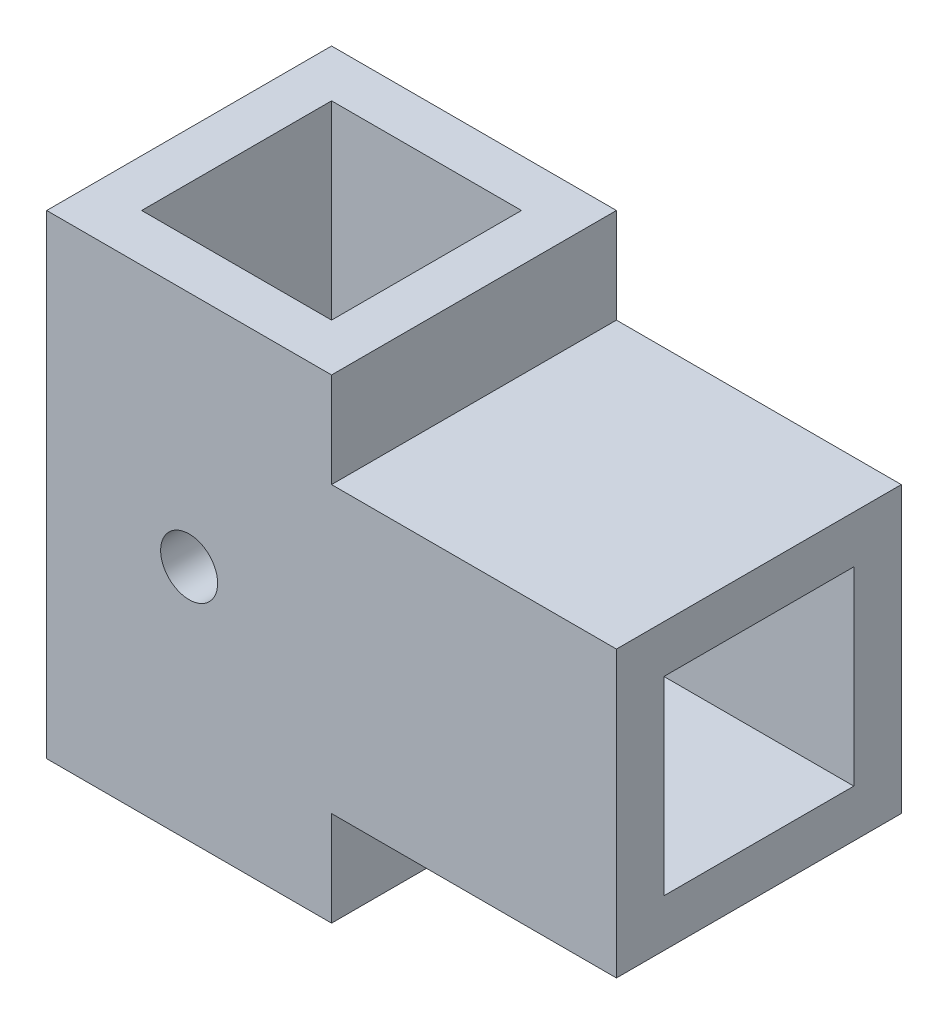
ISO-10303-21;
HEADER;
FILE_DESCRIPTION(('STEP AP214'),'2;1');
FILE_NAME('part.step','',(''),(''),'','','');
FILE_SCHEMA(('AUTOMOTIVE_DESIGN { 1 0 10303 214 1 1 1 1 }'));
ENDSEC;
DATA;
#1=APPLICATION_CONTEXT('core data for automotive mechanical design processes');
#2=APPLICATION_PROTOCOL_DEFINITION('international standard','automotive_design',2000,#1);
#3=PRODUCT_CONTEXT('',#1,'mechanical');
#4=PRODUCT('Part','Part','',(#3));
#5=PRODUCT_RELATED_PRODUCT_CATEGORY('part','',(#4));
#6=PRODUCT_DEFINITION_FORMATION('','',#4);
#7=PRODUCT_DEFINITION_CONTEXT('part definition',#1,'design');
#8=PRODUCT_DEFINITION('design','',#6,#7);
#9=PRODUCT_DEFINITION_SHAPE('','',#8);
#10=(LENGTH_UNIT() NAMED_UNIT(*) SI_UNIT(.MILLI.,.METRE.));
#11=(NAMED_UNIT(*) PLANE_ANGLE_UNIT() SI_UNIT($,.RADIAN.));
#12=(NAMED_UNIT(*) SI_UNIT($,.STERADIAN.) SOLID_ANGLE_UNIT());
#13=UNCERTAINTY_MEASURE_WITH_UNIT(LENGTH_MEASURE(1.E-05),#10,'distance_accuracy_value','');
#14=(GEOMETRIC_REPRESENTATION_CONTEXT(3) GLOBAL_UNCERTAINTY_ASSIGNED_CONTEXT((#13)) GLOBAL_UNIT_ASSIGNED_CONTEXT((#10,
#11,#12)) REPRESENTATION_CONTEXT('',''));
#15=CARTESIAN_POINT('',(0.,0.,0.));
#16=DIRECTION('',(0.,0.,1.));
#17=DIRECTION('',(1.,0.,0.));
#18=AXIS2_PLACEMENT_3D('',#15,#16,#17);
#19=CARTESIAN_POINT('',(0.,0.,15.));
#20=DIRECTION('',(0.,0.,-1.));
#21=DIRECTION('',(-1.,0.,0.));
#22=AXIS2_PLACEMENT_3D('',#19,#20,#21);
#23=CYLINDRICAL_SURFACE('',#22,3.);
#24=CARTESIAN_POINT('',(0.,0.,10.));
#25=DIRECTION('',(0.,0.,1.));
#26=DIRECTION('',(1.,0.,0.));
#27=AXIS2_PLACEMENT_3D('',#24,#25,#26);
#28=CIRCLE('',#27,3.);
#29=CARTESIAN_POINT('',(3.,0.,10.));
#30=VERTEX_POINT('',#29);
#31=EDGE_CURVE('E215',#30,#30,#28,.T.);
#32=ORIENTED_EDGE('',*,*,#31,.F.);
#33=EDGE_LOOP('',(#32));
#34=FACE_BOUND('',#33,.T.);
#35=CARTESIAN_POINT('',(0.,0.,15.));
#36=DIRECTION('',(0.,0.,1.));
#37=DIRECTION('',(1.,0.,0.));
#38=AXIS2_PLACEMENT_3D('',#35,#36,#37);
#39=CIRCLE('',#38,3.);
#40=CARTESIAN_POINT('',(3.,0.,15.));
#41=VERTEX_POINT('',#40);
#42=EDGE_CURVE('E220',#41,#41,#39,.T.);
#43=ORIENTED_EDGE('',*,*,#42,.T.);
#44=EDGE_LOOP('',(#43));
#45=FACE_BOUND('',#44,.T.);
#46=ADVANCED_FACE('F41',(#34,#45),#23,.F.);
#47=CARTESIAN_POINT('',(0.,0.,15.));
#48=DIRECTION('',(0.,0.,1.));
#49=DIRECTION('',(1.,0.,0.));
#50=AXIS2_PLACEMENT_3D('',#47,#48,#49);
#51=PLANE('',#50);
#52=DIRECTION('',(-1.,0.,0.));
#53=VECTOR('',#52,1.);
#54=CARTESIAN_POINT('',(-15.,25.,15.));
#55=LINE('',#54,#53);
#56=CARTESIAN_POINT('',(15.,25.,15.));
#57=VERTEX_POINT('',#56);
#58=CARTESIAN_POINT('',(-15.,25.,15.));
#59=VERTEX_POINT('',#58);
#60=EDGE_CURVE('E226',#57,#59,#55,.T.);
#61=ORIENTED_EDGE('',*,*,#60,.T.);
#62=DIRECTION('',(0.,-1.,0.));
#63=VECTOR('',#62,1.);
#64=CARTESIAN_POINT('',(-15.,-25.,15.));
#65=LINE('',#64,#63);
#66=CARTESIAN_POINT('',(-15.,-25.,15.));
#67=VERTEX_POINT('',#66);
#68=EDGE_CURVE('E229',#59,#67,#65,.T.);
#69=ORIENTED_EDGE('',*,*,#68,.T.);
#70=DIRECTION('',(1.,0.,0.));
#71=VECTOR('',#70,1.);
#72=CARTESIAN_POINT('',(-15.,-25.,15.));
#73=LINE('',#72,#71);
#74=CARTESIAN_POINT('',(15.,-25.,15.));
#75=VERTEX_POINT('',#74);
#76=EDGE_CURVE('E232',#67,#75,#73,.T.);
#77=ORIENTED_EDGE('',*,*,#76,.T.);
#78=DIRECTION('',(0.,1.,0.));
#79=VECTOR('',#78,1.);
#80=CARTESIAN_POINT('',(15.,-25.,15.));
#81=LINE('',#80,#79);
#82=CARTESIAN_POINT('',(15.,-15.,15.));
#83=VERTEX_POINT('',#82);
#84=EDGE_CURVE('E234',#75,#83,#81,.T.);
#85=ORIENTED_EDGE('',*,*,#84,.T.);
#86=DIRECTION('',(1.,0.,0.));
#87=VECTOR('',#86,1.);
#88=CARTESIAN_POINT('',(15.,-15.,15.));
#89=LINE('',#88,#87);
#90=CARTESIAN_POINT('',(45.,-15.,15.));
#91=VERTEX_POINT('',#90);
#92=EDGE_CURVE('E236',#83,#91,#89,.T.);
#93=ORIENTED_EDGE('',*,*,#92,.T.);
#94=DIRECTION('',(0.,1.,0.));
#95=VECTOR('',#94,1.);
#96=CARTESIAN_POINT('',(45.,15.,15.));
#97=LINE('',#96,#95);
#98=CARTESIAN_POINT('',(45.,15.,15.));
#99=VERTEX_POINT('',#98);
#100=EDGE_CURVE('E238',#91,#99,#97,.T.);
#101=ORIENTED_EDGE('',*,*,#100,.T.);
#102=DIRECTION('',(-1.,0.,0.));
#103=VECTOR('',#102,1.);
#104=CARTESIAN_POINT('',(15.,15.,15.));
#105=LINE('',#104,#103);
#106=CARTESIAN_POINT('',(15.,15.,15.));
#107=VERTEX_POINT('',#106);
#108=EDGE_CURVE('E240',#99,#107,#105,.T.);
#109=ORIENTED_EDGE('',*,*,#108,.T.);
#110=DIRECTION('',(0.,1.,0.));
#111=VECTOR('',#110,1.);
#112=CARTESIAN_POINT('',(15.,15.,15.));
#113=LINE('',#112,#111);
#114=EDGE_CURVE('E242',#107,#57,#113,.T.);
#115=ORIENTED_EDGE('',*,*,#114,.T.);
#116=EDGE_LOOP('',(#61,#69,#77,#85,#93,#101,#109,#115));
#117=FACE_BOUND('',#116,.T.);
#118=ORIENTED_EDGE('',*,*,#42,.F.);
#119=EDGE_LOOP('',(#118));
#120=FACE_BOUND('',#119,.T.);
#121=ADVANCED_FACE('F322',(#117,#120),#51,.T.);
#122=CARTESIAN_POINT('',(0.,0.,-15.));
#123=DIRECTION('',(0.,0.,1.));
#124=DIRECTION('',(1.,0.,0.));
#125=AXIS2_PLACEMENT_3D('',#122,#123,#124);
#126=PLANE('',#125);
#127=DIRECTION('',(-1.,0.,0.));
#128=VECTOR('',#127,1.);
#129=CARTESIAN_POINT('',(-15.,25.,-15.));
#130=LINE('',#129,#128);
#131=CARTESIAN_POINT('',(15.,25.,-15.));
#132=VERTEX_POINT('',#131);
#133=CARTESIAN_POINT('',(-15.,25.,-15.));
#134=VERTEX_POINT('',#133);
#135=EDGE_CURVE('E223',#132,#134,#130,.T.);
#136=ORIENTED_EDGE('',*,*,#135,.F.);
#137=DIRECTION('',(0.,1.,0.));
#138=VECTOR('',#137,1.);
#139=CARTESIAN_POINT('',(15.,15.,-15.));
#140=LINE('',#139,#138);
#141=CARTESIAN_POINT('',(15.,15.,-15.));
#142=VERTEX_POINT('',#141);
#143=EDGE_CURVE('E230',#142,#132,#140,.T.);
#144=ORIENTED_EDGE('',*,*,#143,.F.);
#145=DIRECTION('',(-1.,0.,0.));
#146=VECTOR('',#145,1.);
#147=CARTESIAN_POINT('',(15.,15.,-15.));
#148=LINE('',#147,#146);
#149=CARTESIAN_POINT('',(45.,15.,-15.));
#150=VERTEX_POINT('',#149);
#151=EDGE_CURVE('E257',#150,#142,#148,.T.);
#152=ORIENTED_EDGE('',*,*,#151,.F.);
#153=DIRECTION('',(0.,1.,0.));
#154=VECTOR('',#153,1.);
#155=CARTESIAN_POINT('',(45.,15.,-15.));
#156=LINE('',#155,#154);
#157=CARTESIAN_POINT('',(45.,-15.,-15.));
#158=VERTEX_POINT('',#157);
#159=EDGE_CURVE('E255',#158,#150,#156,.T.);
#160=ORIENTED_EDGE('',*,*,#159,.F.);
#161=DIRECTION('',(1.,0.,0.));
#162=VECTOR('',#161,1.);
#163=CARTESIAN_POINT('',(15.,-15.,-15.));
#164=LINE('',#163,#162);
#165=CARTESIAN_POINT('',(15.,-15.,-15.));
#166=VERTEX_POINT('',#165);
#167=EDGE_CURVE('E253',#166,#158,#164,.T.);
#168=ORIENTED_EDGE('',*,*,#167,.F.);
#169=DIRECTION('',(0.,1.,0.));
#170=VECTOR('',#169,1.);
#171=CARTESIAN_POINT('',(15.,-25.,-15.));
#172=LINE('',#171,#170);
#173=CARTESIAN_POINT('',(15.,-25.,-15.));
#174=VERTEX_POINT('',#173);
#175=EDGE_CURVE('E251',#174,#166,#172,.T.);
#176=ORIENTED_EDGE('',*,*,#175,.F.);
#177=DIRECTION('',(1.,0.,0.));
#178=VECTOR('',#177,1.);
#179=CARTESIAN_POINT('',(-15.,-25.,-15.));
#180=LINE('',#179,#178);
#181=CARTESIAN_POINT('',(-15.,-25.,-15.));
#182=VERTEX_POINT('',#181);
#183=EDGE_CURVE('E249',#182,#174,#180,.T.);
#184=ORIENTED_EDGE('',*,*,#183,.F.);
#185=DIRECTION('',(0.,-1.,0.));
#186=VECTOR('',#185,1.);
#187=CARTESIAN_POINT('',(-15.,-25.,-15.));
#188=LINE('',#187,#186);
#189=EDGE_CURVE('E247',#134,#182,#188,.T.);
#190=ORIENTED_EDGE('',*,*,#189,.F.);
#191=EDGE_LOOP('',(#136,#144,#152,#160,#168,#176,#184,#190));
#192=FACE_BOUND('',#191,.T.);
#193=CARTESIAN_POINT('',(0.,0.,-15.));
#194=DIRECTION('',(0.,0.,1.));
#195=DIRECTION('',(1.,0.,0.));
#196=AXIS2_PLACEMENT_3D('',#193,#194,#195);
#197=CIRCLE('',#196,3.);
#198=CARTESIAN_POINT('',(3.,0.,-15.));
#199=VERTEX_POINT('',#198);
#200=EDGE_CURVE('E219',#199,#199,#197,.T.);
#201=ORIENTED_EDGE('',*,*,#200,.T.);
#202=EDGE_LOOP('',(#201));
#203=FACE_BOUND('',#202,.T.);
#204=ADVANCED_FACE('F307',(#192,#203),#126,.F.);
#205=CARTESIAN_POINT('',(-15.,25.,15.));
#206=DIRECTION('',(0.,-1.,0.));
#207=DIRECTION('',(0.,0.,-1.));
#208=AXIS2_PLACEMENT_3D('',#205,#206,#207);
#209=PLANE('',#208);
#210=DIRECTION('',(-1.,0.,0.));
#211=VECTOR('',#210,1.);
#212=CARTESIAN_POINT('',(9.99999999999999,25.,-10.));
#213=LINE('',#212,#211);
#214=CARTESIAN_POINT('',(9.99999999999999,25.,-10.));
#215=VERTEX_POINT('',#214);
#216=CARTESIAN_POINT('',(-10.,25.,-10.));
#217=VERTEX_POINT('',#216);
#218=EDGE_CURVE('E194',#215,#217,#213,.T.);
#219=ORIENTED_EDGE('',*,*,#218,.F.);
#220=DIRECTION('',(0.,0.,-1.));
#221=VECTOR('',#220,1.);
#222=CARTESIAN_POINT('',(9.99999999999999,25.,10.));
#223=LINE('',#222,#221);
#224=CARTESIAN_POINT('',(9.99999999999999,25.,10.));
#225=VERTEX_POINT('',#224);
#226=EDGE_CURVE('E64',#225,#215,#223,.T.);
#227=ORIENTED_EDGE('',*,*,#226,.F.);
#228=DIRECTION('',(1.,0.,0.));
#229=VECTOR('',#228,1.);
#230=CARTESIAN_POINT('',(-10.,25.,10.));
#231=LINE('',#230,#229);
#232=CARTESIAN_POINT('',(-10.,25.,10.));
#233=VERTEX_POINT('',#232);
#234=EDGE_CURVE('E200',#233,#225,#231,.T.);
#235=ORIENTED_EDGE('',*,*,#234,.F.);
#236=DIRECTION('',(0.,0.,1.));
#237=VECTOR('',#236,1.);
#238=CARTESIAN_POINT('',(-10.,25.,-10.));
#239=LINE('',#238,#237);
#240=EDGE_CURVE('E197',#217,#233,#239,.T.);
#241=ORIENTED_EDGE('',*,*,#240,.F.);
#242=EDGE_LOOP('',(#219,#227,#235,#241));
#243=FACE_BOUND('',#242,.T.);
#244=ORIENTED_EDGE('',*,*,#135,.T.);
#245=DIRECTION('',(0.,0.,-1.));
#246=VECTOR('',#245,1.);
#247=CARTESIAN_POINT('',(-15.,25.,15.));
#248=LINE('',#247,#246);
#249=EDGE_CURVE('E280',#59,#134,#248,.T.);
#250=ORIENTED_EDGE('',*,*,#249,.F.);
#251=ORIENTED_EDGE('',*,*,#60,.F.);
#252=DIRECTION('',(0.,0.,-1.));
#253=VECTOR('',#252,1.);
#254=CARTESIAN_POINT('',(15.,25.,15.));
#255=LINE('',#254,#253);
#256=EDGE_CURVE('E244',#57,#132,#255,.T.);
#257=ORIENTED_EDGE('',*,*,#256,.T.);
#258=EDGE_LOOP('',(#244,#250,#251,#257));
#259=FACE_BOUND('',#258,.T.);
#260=ADVANCED_FACE('F43',(#243,#259),#209,.F.);
#261=CARTESIAN_POINT('',(-15.,-25.,15.));
#262=DIRECTION('',(1.,0.,0.));
#263=DIRECTION('',(0.,0.,-1.));
#264=AXIS2_PLACEMENT_3D('',#261,#262,#263);
#265=PLANE('',#264);
#266=ORIENTED_EDGE('',*,*,#189,.T.);
#267=DIRECTION('',(0.,0.,-1.));
#268=VECTOR('',#267,1.);
#269=CARTESIAN_POINT('',(-15.,-25.,15.));
#270=LINE('',#269,#268);
#271=EDGE_CURVE('E277',#67,#182,#270,.T.);
#272=ORIENTED_EDGE('',*,*,#271,.F.);
#273=ORIENTED_EDGE('',*,*,#68,.F.);
#274=ORIENTED_EDGE('',*,*,#249,.T.);
#275=EDGE_LOOP('',(#266,#272,#273,#274));
#276=FACE_BOUND('',#275,.T.);
#277=ADVANCED_FACE('F306',(#276),#265,.F.);
#278=CARTESIAN_POINT('',(-15.,-25.,15.));
#279=DIRECTION('',(0.,1.,0.));
#280=DIRECTION('',(0.,0.,1.));
#281=AXIS2_PLACEMENT_3D('',#278,#279,#280);
#282=PLANE('',#281);
#283=DIRECTION('',(1.,0.,0.));
#284=VECTOR('',#283,1.);
#285=CARTESIAN_POINT('',(-15.,-25.,10.));
#286=LINE('',#285,#284);
#287=CARTESIAN_POINT('',(-10.,-25.,10.));
#288=VERTEX_POINT('',#287);
#289=CARTESIAN_POINT('',(9.99999999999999,-25.,10.));
#290=VERTEX_POINT('',#289);
#291=EDGE_CURVE('E216',#288,#290,#286,.T.);
#292=ORIENTED_EDGE('',*,*,#291,.T.);
#293=DIRECTION('',(0.,0.,-1.));
#294=VECTOR('',#293,1.);
#295=CARTESIAN_POINT('',(9.99999999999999,-25.,15.));
#296=LINE('',#295,#294);
#297=CARTESIAN_POINT('',(9.99999999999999,-25.,-10.));
#298=VERTEX_POINT('',#297);
#299=EDGE_CURVE('E11',#290,#298,#296,.T.);
#300=ORIENTED_EDGE('',*,*,#299,.T.);
#301=DIRECTION('',(-1.,0.,0.));
#302=VECTOR('',#301,1.);
#303=CARTESIAN_POINT('',(-15.,-25.,-10.));
#304=LINE('',#303,#302);
#305=CARTESIAN_POINT('',(-10.,-25.,-10.));
#306=VERTEX_POINT('',#305);
#307=EDGE_CURVE('E212',#298,#306,#304,.T.);
#308=ORIENTED_EDGE('',*,*,#307,.T.);
#309=DIRECTION('',(0.,0.,1.));
#310=VECTOR('',#309,1.);
#311=CARTESIAN_POINT('',(-10.,-25.,15.));
#312=LINE('',#311,#310);
#313=EDGE_CURVE('E49',#306,#288,#312,.T.);
#314=ORIENTED_EDGE('',*,*,#313,.T.);
#315=EDGE_LOOP('',(#292,#300,#308,#314));
#316=FACE_BOUND('',#315,.T.);
#317=ORIENTED_EDGE('',*,*,#183,.T.);
#318=DIRECTION('',(0.,0.,-1.));
#319=VECTOR('',#318,1.);
#320=CARTESIAN_POINT('',(15.,-25.,15.));
#321=LINE('',#320,#319);
#322=EDGE_CURVE('E274',#75,#174,#321,.T.);
#323=ORIENTED_EDGE('',*,*,#322,.F.);
#324=ORIENTED_EDGE('',*,*,#76,.F.);
#325=ORIENTED_EDGE('',*,*,#271,.T.);
#326=EDGE_LOOP('',(#317,#323,#324,#325));
#327=FACE_BOUND('',#326,.T.);
#328=ADVANCED_FACE('F289',(#316,#327),#282,.F.);
#329=CARTESIAN_POINT('',(15.,-25.,15.));
#330=DIRECTION('',(-1.,0.,0.));
#331=DIRECTION('',(0.,-1.,0.));
#332=AXIS2_PLACEMENT_3D('',#329,#330,#331);
#333=PLANE('',#332);
#334=ORIENTED_EDGE('',*,*,#175,.T.);
#335=DIRECTION('',(0.,0.,-1.));
#336=VECTOR('',#335,1.);
#337=CARTESIAN_POINT('',(15.,-15.,15.));
#338=LINE('',#337,#336);
#339=EDGE_CURVE('E271',#83,#166,#338,.T.);
#340=ORIENTED_EDGE('',*,*,#339,.F.);
#341=ORIENTED_EDGE('',*,*,#84,.F.);
#342=ORIENTED_EDGE('',*,*,#322,.T.);
#343=EDGE_LOOP('',(#334,#340,#341,#342));
#344=FACE_BOUND('',#343,.T.);
#345=ADVANCED_FACE('F344',(#344),#333,.F.);
#346=CARTESIAN_POINT('',(15.,-15.,15.));
#347=DIRECTION('',(0.,1.,0.));
#348=DIRECTION('',(0.,0.,1.));
#349=AXIS2_PLACEMENT_3D('',#346,#347,#348);
#350=PLANE('',#349);
#351=ORIENTED_EDGE('',*,*,#167,.T.);
#352=DIRECTION('',(0.,0.,-1.));
#353=VECTOR('',#352,1.);
#354=CARTESIAN_POINT('',(45.,-15.,15.));
#355=LINE('',#354,#353);
#356=EDGE_CURVE('E268',#91,#158,#355,.T.);
#357=ORIENTED_EDGE('',*,*,#356,.F.);
#358=ORIENTED_EDGE('',*,*,#92,.F.);
#359=ORIENTED_EDGE('',*,*,#339,.T.);
#360=EDGE_LOOP('',(#351,#357,#358,#359));
#361=FACE_BOUND('',#360,.T.);
#362=ADVANCED_FACE('F340',(#361),#350,.F.);
#363=CARTESIAN_POINT('',(45.,15.,15.));
#364=DIRECTION('',(-1.,0.,0.));
#365=DIRECTION('',(0.,0.,1.));
#366=AXIS2_PLACEMENT_3D('',#363,#364,#365);
#367=PLANE('',#366);
#368=DIRECTION('',(0.,1.,0.));
#369=VECTOR('',#368,1.);
#370=CARTESIAN_POINT('',(45.,-10.,-10.));
#371=LINE('',#370,#369);
#372=CARTESIAN_POINT('',(45.,-9.99999999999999,-10.));
#373=VERTEX_POINT('',#372);
#374=CARTESIAN_POINT('',(45.,10.,-10.));
#375=VERTEX_POINT('',#374);
#376=EDGE_CURVE('E184',#373,#375,#371,.T.);
#377=ORIENTED_EDGE('',*,*,#376,.F.);
#378=DIRECTION('',(0.,0.,-1.));
#379=VECTOR('',#378,1.);
#380=CARTESIAN_POINT('',(45.,-10.,10.));
#381=LINE('',#380,#379);
#382=CARTESIAN_POINT('',(45.,-10.,10.));
#383=VERTEX_POINT('',#382);
#384=EDGE_CURVE('E56',#383,#373,#381,.T.);
#385=ORIENTED_EDGE('',*,*,#384,.F.);
#386=DIRECTION('',(0.,-1.,0.));
#387=VECTOR('',#386,1.);
#388=CARTESIAN_POINT('',(45.,10.,10.));
#389=LINE('',#388,#387);
#390=CARTESIAN_POINT('',(45.,10.,10.));
#391=VERTEX_POINT('',#390);
#392=EDGE_CURVE('E175',#391,#383,#389,.T.);
#393=ORIENTED_EDGE('',*,*,#392,.F.);
#394=DIRECTION('',(0.,0.,1.));
#395=VECTOR('',#394,1.);
#396=CARTESIAN_POINT('',(45.,10.,-10.));
#397=LINE('',#396,#395);
#398=EDGE_CURVE('E178',#375,#391,#397,.T.);
#399=ORIENTED_EDGE('',*,*,#398,.F.);
#400=EDGE_LOOP('',(#377,#385,#393,#399));
#401=FACE_BOUND('',#400,.T.);
#402=ORIENTED_EDGE('',*,*,#159,.T.);
#403=DIRECTION('',(0.,0.,-1.));
#404=VECTOR('',#403,1.);
#405=CARTESIAN_POINT('',(45.,15.,15.));
#406=LINE('',#405,#404);
#407=EDGE_CURVE('E265',#99,#150,#406,.T.);
#408=ORIENTED_EDGE('',*,*,#407,.F.);
#409=ORIENTED_EDGE('',*,*,#100,.F.);
#410=ORIENTED_EDGE('',*,*,#356,.T.);
#411=EDGE_LOOP('',(#402,#408,#409,#410));
#412=FACE_BOUND('',#411,.T.);
#413=ADVANCED_FACE('F335',(#401,#412),#367,.F.);
#414=CARTESIAN_POINT('',(15.,15.,15.));
#415=DIRECTION('',(0.,-1.,0.));
#416=DIRECTION('',(0.,0.,-1.));
#417=AXIS2_PLACEMENT_3D('',#414,#415,#416);
#418=PLANE('',#417);
#419=ORIENTED_EDGE('',*,*,#151,.T.);
#420=DIRECTION('',(0.,0.,-1.));
#421=VECTOR('',#420,1.);
#422=CARTESIAN_POINT('',(15.,15.,15.));
#423=LINE('',#422,#421);
#424=EDGE_CURVE('E262',#107,#142,#423,.T.);
#425=ORIENTED_EDGE('',*,*,#424,.F.);
#426=ORIENTED_EDGE('',*,*,#108,.F.);
#427=ORIENTED_EDGE('',*,*,#407,.T.);
#428=EDGE_LOOP('',(#419,#425,#426,#427));
#429=FACE_BOUND('',#428,.T.);
#430=ADVANCED_FACE('F330',(#429),#418,.F.);
#431=CARTESIAN_POINT('',(15.,15.,15.));
#432=DIRECTION('',(-1.,0.,0.));
#433=DIRECTION('',(0.,-1.,0.));
#434=AXIS2_PLACEMENT_3D('',#431,#432,#433);
#435=PLANE('',#434);
#436=ORIENTED_EDGE('',*,*,#143,.T.);
#437=ORIENTED_EDGE('',*,*,#256,.F.);
#438=ORIENTED_EDGE('',*,*,#114,.F.);
#439=ORIENTED_EDGE('',*,*,#424,.T.);
#440=EDGE_LOOP('',(#436,#437,#438,#439));
#441=FACE_BOUND('',#440,.T.);
#442=ADVANCED_FACE('F328',(#441),#435,.F.);
#443=CARTESIAN_POINT('',(0.,0.,-10.));
#444=DIRECTION('',(0.,0.,-1.));
#445=DIRECTION('',(-1.,0.,0.));
#446=AXIS2_PLACEMENT_3D('',#443,#444,#445);
#447=CIRCLE('',#446,3.);
#448=CARTESIAN_POINT('',(-3.,0.,-10.));
#449=VERTEX_POINT('',#448);
#450=EDGE_CURVE('E206',#449,#449,#447,.T.);
#451=ORIENTED_EDGE('',*,*,#450,.F.);
#452=EDGE_LOOP('',(#451));
#453=FACE_BOUND('',#452,.T.);
#454=ORIENTED_EDGE('',*,*,#200,.F.);
#455=EDGE_LOOP('',(#454));
#456=FACE_BOUND('',#455,.T.);
#457=ADVANCED_FACE('F356',(#453,#456),#23,.F.);
#458=CARTESIAN_POINT('',(9.99999999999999,-34.,10.));
#459=DIRECTION('',(1.,0.,0.));
#460=DIRECTION('',(0.,0.,-1.));
#461=AXIS2_PLACEMENT_3D('',#458,#459,#460);
#462=PLANE('',#461);
#463=DIRECTION('',(0.,1.,0.));
#464=VECTOR('',#463,1.);
#465=CARTESIAN_POINT('',(9.99999999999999,-34.,10.));
#466=LINE('',#465,#464);
#467=EDGE_CURVE('E204',#290,#225,#466,.T.);
#468=ORIENTED_EDGE('',*,*,#467,.T.);
#469=ORIENTED_EDGE('',*,*,#226,.T.);
#470=DIRECTION('',(0.,1.,0.));
#471=VECTOR('',#470,1.);
#472=CARTESIAN_POINT('',(9.99999999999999,-34.,-10.));
#473=LINE('',#472,#471);
#474=EDGE_CURVE('E203',#298,#215,#473,.T.);
#475=ORIENTED_EDGE('',*,*,#474,.F.);
#476=ORIENTED_EDGE('',*,*,#299,.F.);
#477=EDGE_LOOP('',(#468,#469,#475,#476));
#478=FACE_BOUND('',#477,.T.);
#479=ADVANCED_FACE('F299',(#478),#462,.F.);
#480=CARTESIAN_POINT('',(-10.,-34.,-10.));
#481=DIRECTION('',(-1.,0.,0.));
#482=DIRECTION('',(0.,0.,1.));
#483=AXIS2_PLACEMENT_3D('',#480,#481,#482);
#484=PLANE('',#483);
#485=DIRECTION('',(0.,1.,0.));
#486=VECTOR('',#485,1.);
#487=CARTESIAN_POINT('',(-10.,-34.,-10.));
#488=LINE('',#487,#486);
#489=EDGE_CURVE('E209',#306,#217,#488,.T.);
#490=ORIENTED_EDGE('',*,*,#489,.T.);
#491=ORIENTED_EDGE('',*,*,#240,.T.);
#492=DIRECTION('',(0.,1.,0.));
#493=VECTOR('',#492,1.);
#494=CARTESIAN_POINT('',(-10.,-34.,10.));
#495=LINE('',#494,#493);
#496=EDGE_CURVE('E207',#288,#233,#495,.T.);
#497=ORIENTED_EDGE('',*,*,#496,.F.);
#498=ORIENTED_EDGE('',*,*,#313,.F.);
#499=EDGE_LOOP('',(#490,#491,#497,#498));
#500=FACE_BOUND('',#499,.T.);
#501=ADVANCED_FACE('F293',(#500),#484,.F.);
#502=CARTESIAN_POINT('',(-10.,-34.,10.));
#503=DIRECTION('',(0.,0.,1.));
#504=DIRECTION('',(1.,0.,0.));
#505=AXIS2_PLACEMENT_3D('',#502,#503,#504);
#506=PLANE('',#505);
#507=ORIENTED_EDGE('',*,*,#31,.T.);
#508=EDGE_LOOP('',(#507));
#509=FACE_BOUND('',#508,.T.);
#510=ORIENTED_EDGE('',*,*,#496,.T.);
#511=ORIENTED_EDGE('',*,*,#234,.T.);
#512=ORIENTED_EDGE('',*,*,#467,.F.);
#513=ORIENTED_EDGE('',*,*,#291,.F.);
#514=EDGE_LOOP('',(#510,#511,#512,#513));
#515=FACE_BOUND('',#514,.T.);
#516=ADVANCED_FACE('F297',(#509,#515),#506,.F.);
#517=CARTESIAN_POINT('',(9.99999999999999,-34.,-10.));
#518=DIRECTION('',(0.,0.,-1.));
#519=DIRECTION('',(-1.,0.,0.));
#520=AXIS2_PLACEMENT_3D('',#517,#518,#519);
#521=PLANE('',#520);
#522=ORIENTED_EDGE('',*,*,#450,.T.);
#523=EDGE_LOOP('',(#522));
#524=FACE_BOUND('',#523,.T.);
#525=ORIENTED_EDGE('',*,*,#474,.T.);
#526=ORIENTED_EDGE('',*,*,#218,.T.);
#527=ORIENTED_EDGE('',*,*,#489,.F.);
#528=ORIENTED_EDGE('',*,*,#307,.F.);
#529=EDGE_LOOP('',(#525,#526,#527,#528));
#530=FACE_BOUND('',#529,.T.);
#531=ADVANCED_FACE('F302',(#524,#530),#521,.F.);
#532=CARTESIAN_POINT('',(20.,-10.,10.));
#533=DIRECTION('',(0.,-1.,0.));
#534=DIRECTION('',(0.,0.,-1.));
#535=AXIS2_PLACEMENT_3D('',#532,#533,#534);
#536=PLANE('',#535);
#537=ORIENTED_EDGE('',*,*,#384,.T.);
#538=DIRECTION('',(1.,0.,0.));
#539=VECTOR('',#538,1.);
#540=CARTESIAN_POINT('',(20.,-10.,-10.));
#541=LINE('',#540,#539);
#542=CARTESIAN_POINT('',(20.,-10.,-10.));
#543=VERTEX_POINT('',#542);
#544=EDGE_CURVE('E153',#543,#373,#541,.T.);
#545=ORIENTED_EDGE('',*,*,#544,.F.);
#546=DIRECTION('',(0.,0.,-1.));
#547=VECTOR('',#546,1.);
#548=CARTESIAN_POINT('',(20.,-10.,10.));
#549=LINE('',#548,#547);
#550=CARTESIAN_POINT('',(20.,-10.,10.));
#551=VERTEX_POINT('',#550);
#552=EDGE_CURVE('E157',#551,#543,#549,.T.);
#553=ORIENTED_EDGE('',*,*,#552,.F.);
#554=DIRECTION('',(1.,0.,0.));
#555=VECTOR('',#554,1.);
#556=CARTESIAN_POINT('',(20.,-10.,10.));
#557=LINE('',#556,#555);
#558=EDGE_CURVE('E188',#551,#383,#557,.T.);
#559=ORIENTED_EDGE('',*,*,#558,.T.);
#560=EDGE_LOOP('',(#537,#545,#553,#559));
#561=FACE_BOUND('',#560,.T.);
#562=ADVANCED_FACE('F155',(#561),#536,.F.);
#563=CARTESIAN_POINT('',(20.,10.,10.));
#564=DIRECTION('',(0.,0.,1.));
#565=DIRECTION('',(1.,0.,0.));
#566=AXIS2_PLACEMENT_3D('',#563,#564,#565);
#567=PLANE('',#566);
#568=ORIENTED_EDGE('',*,*,#392,.T.);
#569=ORIENTED_EDGE('',*,*,#558,.F.);
#570=DIRECTION('',(0.,-1.,0.));
#571=VECTOR('',#570,1.);
#572=CARTESIAN_POINT('',(20.,10.,10.));
#573=LINE('',#572,#571);
#574=CARTESIAN_POINT('',(20.,10.,10.));
#575=VERTEX_POINT('',#574);
#576=EDGE_CURVE('E163',#575,#551,#573,.T.);
#577=ORIENTED_EDGE('',*,*,#576,.F.);
#578=DIRECTION('',(1.,0.,0.));
#579=VECTOR('',#578,1.);
#580=CARTESIAN_POINT('',(20.,10.,10.));
#581=LINE('',#580,#579);
#582=EDGE_CURVE('E190',#575,#391,#581,.T.);
#583=ORIENTED_EDGE('',*,*,#582,.T.);
#584=EDGE_LOOP('',(#568,#569,#577,#583));
#585=FACE_BOUND('',#584,.T.);
#586=ADVANCED_FACE('F471',(#585),#567,.F.);
#587=CARTESIAN_POINT('',(20.,10.,-10.));
#588=DIRECTION('',(0.,1.,0.));
#589=DIRECTION('',(0.,0.,1.));
#590=AXIS2_PLACEMENT_3D('',#587,#588,#589);
#591=PLANE('',#590);
#592=ORIENTED_EDGE('',*,*,#398,.T.);
#593=ORIENTED_EDGE('',*,*,#582,.F.);
#594=DIRECTION('',(0.,0.,1.));
#595=VECTOR('',#594,1.);
#596=CARTESIAN_POINT('',(20.,10.,-10.));
#597=LINE('',#596,#595);
#598=CARTESIAN_POINT('',(20.,10.,-10.));
#599=VERTEX_POINT('',#598);
#600=EDGE_CURVE('E171',#599,#575,#597,.T.);
#601=ORIENTED_EDGE('',*,*,#600,.F.);
#602=DIRECTION('',(1.,0.,0.));
#603=VECTOR('',#602,1.);
#604=CARTESIAN_POINT('',(20.,10.,-10.));
#605=LINE('',#604,#603);
#606=EDGE_CURVE('E162',#599,#375,#605,.T.);
#607=ORIENTED_EDGE('',*,*,#606,.T.);
#608=EDGE_LOOP('',(#592,#593,#601,#607));
#609=FACE_BOUND('',#608,.T.);
#610=ADVANCED_FACE('F477',(#609),#591,.F.);
#611=CARTESIAN_POINT('',(20.,-10.,-10.));
#612=DIRECTION('',(0.,0.,-1.));
#613=DIRECTION('',(-1.,0.,0.));
#614=AXIS2_PLACEMENT_3D('',#611,#612,#613);
#615=PLANE('',#614);
#616=ORIENTED_EDGE('',*,*,#376,.T.);
#617=ORIENTED_EDGE('',*,*,#606,.F.);
#618=DIRECTION('',(0.,1.,0.));
#619=VECTOR('',#618,1.);
#620=CARTESIAN_POINT('',(20.,-10.,-10.));
#621=LINE('',#620,#619);
#622=EDGE_CURVE('E166',#543,#599,#621,.T.);
#623=ORIENTED_EDGE('',*,*,#622,.F.);
#624=ORIENTED_EDGE('',*,*,#544,.T.);
#625=EDGE_LOOP('',(#616,#617,#623,#624));
#626=FACE_BOUND('',#625,.T.);
#627=ADVANCED_FACE('F167',(#626),#615,.F.);
#628=CARTESIAN_POINT('',(20.,0.,0.));
#629=DIRECTION('',(1.,0.,0.));
#630=DIRECTION('',(0.,0.,-1.));
#631=AXIS2_PLACEMENT_3D('',#628,#629,#630);
#632=PLANE('',#631);
#633=ORIENTED_EDGE('',*,*,#552,.T.);
#634=ORIENTED_EDGE('',*,*,#622,.T.);
#635=ORIENTED_EDGE('',*,*,#600,.T.);
#636=ORIENTED_EDGE('',*,*,#576,.T.);
#637=EDGE_LOOP('',(#633,#634,#635,#636));
#638=FACE_BOUND('',#637,.T.);
#639=ADVANCED_FACE('F173',(#638),#632,.T.);
#640=CLOSED_SHELL('',(#46,#121,#204,#260,#277,#328,#345,#362,#413,#430,#442,#457,#479,#501,#516,
#531,#562,#586,#610,#627,#639));
#641=MANIFOLD_SOLID_BREP('B2',#640);
#642=ADVANCED_BREP_SHAPE_REPRESENTATION('',(#18,#641),#14);
#643=SHAPE_DEFINITION_REPRESENTATION(#9,#642);
ENDSEC;
END-ISO-10303-21;
